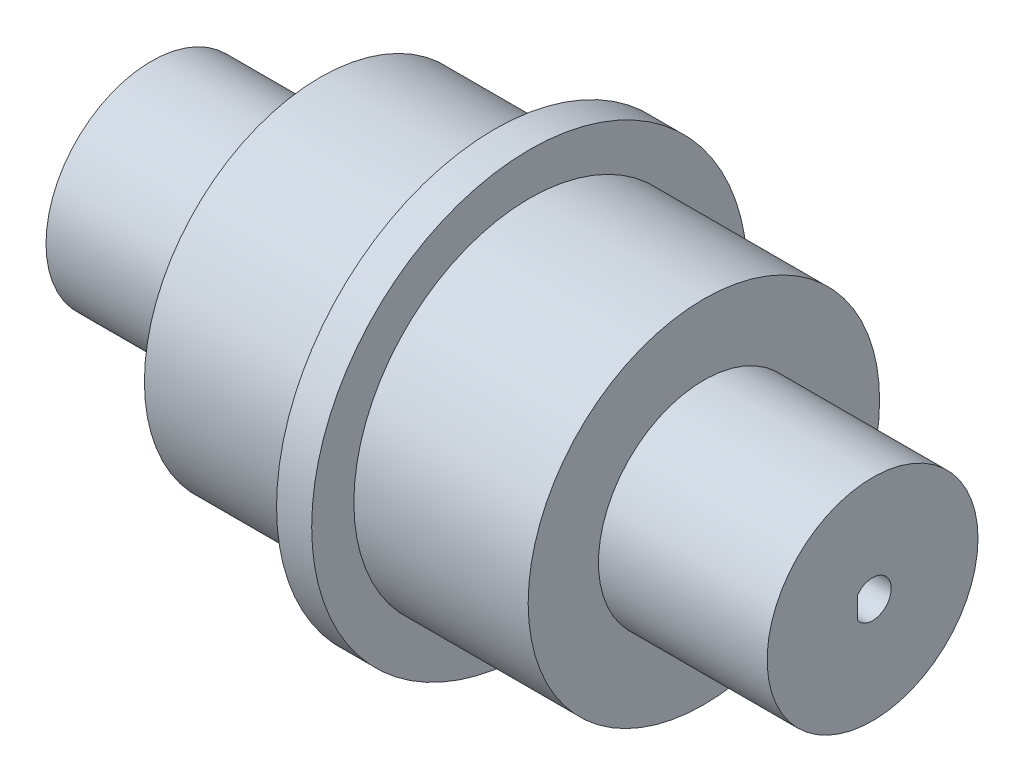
from build123d import *

# Parameters (mm, degrees)
CROQUIS1_R                 = 25
SALIENTE_EXTRUIR1_DEPTH    = 27.3
CROQUIS2_R                 = 15
SALIENTE_EXTRUIR2_DEPTH    = 24
SALIENTE_EXTRUIR3_START    = 24
CROQUIS3_R                 = 15
SALIENTE_EXTRUIR3_DEPTH    = 24
CORTAR_EXTRUIR1_DEPTH      = 109.52078142
CORTAR_EXTRUIR1_DEPTH_BACK = 109.52078142
CROQUIS5_R                 = 31
SALIENTE_EXTRUIR4_DEPTH    = 2.5


with BuildPart() as part:
    # Croquis1 → Saliente-Extruir1 (new, symmetric)
    with BuildSketch(Plane(origin=(0, 0, 0), x_dir=(0, 0, -1), z_dir=(1, 0, 0))):
        Circle(CROQUIS1_R)
    extrude(amount=SALIENTE_EXTRUIR1_DEPTH, both=True)

    # Croquis2 → Saliente-Extruir2 (add)
    with BuildSketch(Plane.ZY.offset(27.3)):
        Circle(CROQUIS2_R)
    extrude(amount=SALIENTE_EXTRUIR2_DEPTH)

    # Croquis3 → Saliente-Extruir3 (add)
    with BuildSketch(Plane(origin=(27.3, 0, 0), x_dir=(0, 0, -1), z_dir=(1, 0, 0)).offset(SALIENTE_EXTRUIR3_START)):
        with Locations(Location((0, 0, 0), (0, 0, 180))):
            Circle(CROQUIS3_R)
    extrude(amount=-SALIENTE_EXTRUIR3_DEPTH)

    # Croquis4 → Cortar-Extruir1 (cut, two sides: drawn at the far end of the back side and taken through both)
    with BuildSketch(Plane(origin=(51.3, 0, 0), x_dir=(0, 0, -1), z_dir=(1, 0, 0)).offset(-CORTAR_EXTRUIR1_DEPTH_BACK)):
        with BuildLine():
            Line((-2.15, 1.549193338), (-2.15, -1.549193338))
            ThreePointArc((-2.15, -1.549193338), (2.65, 0), (-2.15, 1.549193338))
        make_face()
    extrude(amount=CORTAR_EXTRUIR1_DEPTH + CORTAR_EXTRUIR1_DEPTH_BACK, mode=Mode.SUBTRACT)

    # Croquis5 → Saliente-Extruir4 (add, symmetric)
    with BuildSketch(Plane(origin=(0, 0, 0), x_dir=(0, 0, -1), z_dir=(1, 0, 0))):
        Circle(CROQUIS5_R)
    extrude(amount=SALIENTE_EXTRUIR4_DEPTH, both=True)


solid = part.part
